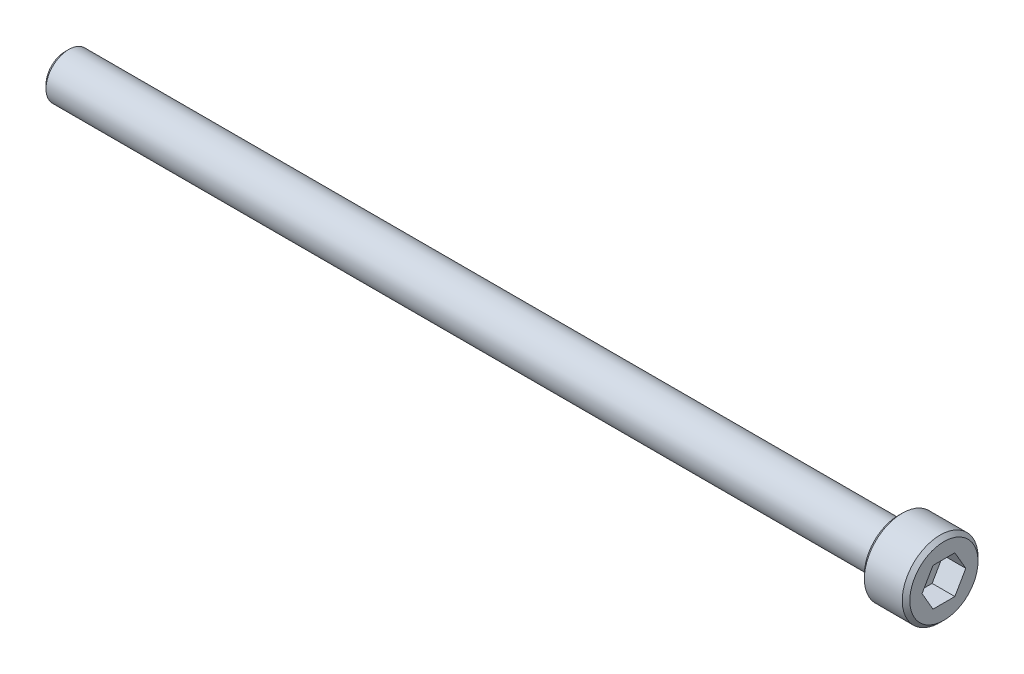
ISO-10303-21;
HEADER;
FILE_DESCRIPTION(('STEP AP214'),'2;1');
FILE_NAME('part.step','',(''),(''),'','','');
FILE_SCHEMA(('AUTOMOTIVE_DESIGN { 1 0 10303 214 1 1 1 1 }'));
ENDSEC;
DATA;
#1=APPLICATION_CONTEXT('core data for automotive mechanical design processes');
#2=APPLICATION_PROTOCOL_DEFINITION('international standard','automotive_design',2000,#1);
#3=PRODUCT_CONTEXT('',#1,'mechanical');
#4=PRODUCT('Part','Part','',(#3));
#5=PRODUCT_RELATED_PRODUCT_CATEGORY('part','',(#4));
#6=PRODUCT_DEFINITION_FORMATION('','',#4);
#7=PRODUCT_DEFINITION_CONTEXT('part definition',#1,'design');
#8=PRODUCT_DEFINITION('design','',#6,#7);
#9=PRODUCT_DEFINITION_SHAPE('','',#8);
#10=(LENGTH_UNIT() NAMED_UNIT(*) SI_UNIT(.MILLI.,.METRE.));
#11=(NAMED_UNIT(*) PLANE_ANGLE_UNIT() SI_UNIT($,.RADIAN.));
#12=(NAMED_UNIT(*) SI_UNIT($,.STERADIAN.) SOLID_ANGLE_UNIT());
#13=UNCERTAINTY_MEASURE_WITH_UNIT(LENGTH_MEASURE(1.E-05),#10,'distance_accuracy_value','');
#14=(GEOMETRIC_REPRESENTATION_CONTEXT(3) GLOBAL_UNCERTAINTY_ASSIGNED_CONTEXT((#13)) GLOBAL_UNIT_ASSIGNED_CONTEXT((#10,
#11,#12)) REPRESENTATION_CONTEXT('',''));
#15=CARTESIAN_POINT('',(0.,0.,0.));
#16=DIRECTION('',(0.,0.,1.));
#17=DIRECTION('',(1.,0.,0.));
#18=AXIS2_PLACEMENT_3D('',#15,#16,#17);
#19=CARTESIAN_POINT('',(-116.,0.,0.));
#20=DIRECTION('',(-1.,0.,0.));
#21=DIRECTION('',(0.,-1.,0.));
#22=AXIS2_PLACEMENT_3D('',#19,#20,#21);
#23=PLANE('',#22);
#24=CARTESIAN_POINT('',(-116.,0.,0.));
#25=DIRECTION('',(-1.,0.,0.));
#26=DIRECTION('',(0.,-1.,0.));
#27=AXIS2_PLACEMENT_3D('',#24,#25,#26);
#28=CIRCLE('',#27,2.50000000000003);
#29=CARTESIAN_POINT('',(-116.,-2.50000000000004,0.));
#30=VERTEX_POINT('',#29);
#31=EDGE_CURVE('E11',#30,#30,#28,.T.);
#32=ORIENTED_EDGE('',*,*,#31,.T.);
#33=EDGE_LOOP('',(#32));
#34=FACE_BOUND('',#33,.T.);
#35=ADVANCED_FACE('F43',(#34),#23,.T.);
#36=CARTESIAN_POINT('',(0.,0.,0.));
#37=DIRECTION('',(1.,0.,0.));
#38=DIRECTION('',(0.,1.,0.));
#39=AXIS2_PLACEMENT_3D('',#36,#37,#38);
#40=CYLINDRICAL_SURFACE('',#39,2.99999999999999);
#41=CARTESIAN_POINT('',(-115.5,0.,0.));
#42=DIRECTION('',(-1.,0.,0.));
#43=DIRECTION('',(0.,-1.,0.));
#44=AXIS2_PLACEMENT_3D('',#41,#42,#43);
#45=CIRCLE('',#44,2.99999999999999);
#46=CARTESIAN_POINT('',(-115.5,-3.00000000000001,0.));
#47=VERTEX_POINT('',#46);
#48=EDGE_CURVE('E53',#47,#47,#45,.F.);
#49=ORIENTED_EDGE('',*,*,#48,.T.);
#50=EDGE_LOOP('',(#49));
#51=FACE_BOUND('',#50,.T.);
#52=CARTESIAN_POINT('',(-6.,0.,0.));
#53=DIRECTION('',(1.,0.,0.));
#54=DIRECTION('',(0.,1.,0.));
#55=AXIS2_PLACEMENT_3D('',#52,#53,#54);
#56=CIRCLE('',#55,2.99999999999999);
#57=CARTESIAN_POINT('',(-6.,2.99999999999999,0.));
#58=VERTEX_POINT('',#57);
#59=EDGE_CURVE('E159',#58,#58,#56,.T.);
#60=ORIENTED_EDGE('',*,*,#59,.F.);
#61=EDGE_LOOP('',(#60));
#62=FACE_BOUND('',#61,.T.);
#63=ADVANCED_FACE('F191',(#51,#62),#40,.T.);
#64=CARTESIAN_POINT('',(-6.,2.99999999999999,0.));
#65=DIRECTION('',(-1.,0.,0.));
#66=DIRECTION('',(0.,-1.,0.));
#67=AXIS2_PLACEMENT_3D('',#64,#65,#66);
#68=PLANE('',#67);
#69=CARTESIAN_POINT('',(-6.,0.,0.));
#70=DIRECTION('',(-1.,0.,0.));
#71=DIRECTION('',(0.,-1.,0.));
#72=AXIS2_PLACEMENT_3D('',#69,#70,#71);
#73=CIRCLE('',#72,4.49999999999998);
#74=CARTESIAN_POINT('',(-6.,-4.49999999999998,0.));
#75=VERTEX_POINT('',#74);
#76=EDGE_CURVE('E184',#75,#75,#73,.T.);
#77=ORIENTED_EDGE('',*,*,#76,.T.);
#78=EDGE_LOOP('',(#77));
#79=FACE_BOUND('',#78,.T.);
#80=ORIENTED_EDGE('',*,*,#59,.T.);
#81=EDGE_LOOP('',(#80));
#82=FACE_BOUND('',#81,.T.);
#83=ADVANCED_FACE('F209',(#79,#82),#68,.T.);
#84=CARTESIAN_POINT('',(0.,0.,0.));
#85=DIRECTION('',(1.,0.,0.));
#86=DIRECTION('',(0.,1.,0.));
#87=AXIS2_PLACEMENT_3D('',#84,#85,#86);
#88=CYLINDRICAL_SURFACE('',#87,5.);
#89=CARTESIAN_POINT('',(-0.5,0.,0.));
#90=DIRECTION('',(1.,0.,0.));
#91=DIRECTION('',(0.,1.,0.));
#92=AXIS2_PLACEMENT_3D('',#89,#90,#91);
#93=CIRCLE('',#92,5.);
#94=CARTESIAN_POINT('',(-0.500000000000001,5.,0.));
#95=VERTEX_POINT('',#94);
#96=EDGE_CURVE('E180',#95,#95,#93,.F.);
#97=ORIENTED_EDGE('',*,*,#96,.T.);
#98=EDGE_LOOP('',(#97));
#99=FACE_BOUND('',#98,.T.);
#100=CARTESIAN_POINT('',(-5.49999999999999,0.,0.));
#101=DIRECTION('',(-1.,0.,0.));
#102=DIRECTION('',(0.,-1.,0.));
#103=AXIS2_PLACEMENT_3D('',#100,#101,#102);
#104=CIRCLE('',#103,5.);
#105=CARTESIAN_POINT('',(-5.49999999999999,-5.,0.));
#106=VERTEX_POINT('',#105);
#107=EDGE_CURVE('E176',#106,#106,#104,.F.);
#108=ORIENTED_EDGE('',*,*,#107,.T.);
#109=EDGE_LOOP('',(#108));
#110=FACE_BOUND('',#109,.T.);
#111=ADVANCED_FACE('F236',(#99,#110),#88,.T.);
#112=CARTESIAN_POINT('',(0.,5.,0.));
#113=DIRECTION('',(1.,0.,0.));
#114=DIRECTION('',(0.,1.,0.));
#115=AXIS2_PLACEMENT_3D('',#112,#113,#114);
#116=PLANE('',#115);
#117=CARTESIAN_POINT('',(0.,0.,0.));
#118=DIRECTION('',(1.,0.,0.));
#119=DIRECTION('',(0.,1.,0.));
#120=AXIS2_PLACEMENT_3D('',#117,#118,#119);
#121=CIRCLE('',#120,4.49999999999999);
#122=CARTESIAN_POINT('',(0.,4.49999999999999,0.));
#123=VERTEX_POINT('',#122);
#124=EDGE_CURVE('E172',#123,#123,#121,.T.);
#125=ORIENTED_EDGE('',*,*,#124,.T.);
#126=EDGE_LOOP('',(#125));
#127=FACE_BOUND('',#126,.T.);
#128=DIRECTION('',(0.,0.866025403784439,-0.5));
#129=VECTOR('',#128,1.);
#130=CARTESIAN_POINT('',(0.,-2.5,-1.44337567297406));
#131=LINE('',#130,#129);
#132=CARTESIAN_POINT('',(0.,-2.5,-1.44337567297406));
#133=VERTEX_POINT('',#132);
#134=CARTESIAN_POINT('',(0.,0.,-2.88675134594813));
#135=VERTEX_POINT('',#134);
#136=EDGE_CURVE('E60',#133,#135,#131,.T.);
#137=ORIENTED_EDGE('',*,*,#136,.F.);
#138=DIRECTION('',(0.,0.,-1.));
#139=VECTOR('',#138,1.);
#140=CARTESIAN_POINT('',(0.,-2.5,1.44337567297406));
#141=LINE('',#140,#139);
#142=CARTESIAN_POINT('',(0.,-2.5,1.44337567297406));
#143=VERTEX_POINT('',#142);
#144=EDGE_CURVE('E153',#143,#133,#141,.T.);
#145=ORIENTED_EDGE('',*,*,#144,.F.);
#146=DIRECTION('',(0.,-0.866025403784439,-0.5));
#147=VECTOR('',#146,1.);
#148=CARTESIAN_POINT('',(0.,0.,2.88675134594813));
#149=LINE('',#148,#147);
#150=CARTESIAN_POINT('',(0.,0.,2.88675134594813));
#151=VERTEX_POINT('',#150);
#152=EDGE_CURVE('E150',#151,#143,#149,.T.);
#153=ORIENTED_EDGE('',*,*,#152,.F.);
#154=DIRECTION('',(0.,-0.866025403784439,0.5));
#155=VECTOR('',#154,1.);
#156=CARTESIAN_POINT('',(0.,2.5,1.44337567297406));
#157=LINE('',#156,#155);
#158=CARTESIAN_POINT('',(0.,2.5,1.44337567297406));
#159=VERTEX_POINT('',#158);
#160=EDGE_CURVE('E108',#159,#151,#157,.T.);
#161=ORIENTED_EDGE('',*,*,#160,.F.);
#162=DIRECTION('',(0.,0.,1.));
#163=VECTOR('',#162,1.);
#164=CARTESIAN_POINT('',(0.,2.5,-1.44337567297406));
#165=LINE('',#164,#163);
#166=CARTESIAN_POINT('',(0.,2.5,-1.44337567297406));
#167=VERTEX_POINT('',#166);
#168=EDGE_CURVE('E144',#167,#159,#165,.T.);
#169=ORIENTED_EDGE('',*,*,#168,.F.);
#170=DIRECTION('',(0.,0.866025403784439,0.5));
#171=VECTOR('',#170,1.);
#172=CARTESIAN_POINT('',(0.,0.,-2.88675134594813));
#173=LINE('',#172,#171);
#174=EDGE_CURVE('E140',#135,#167,#173,.T.);
#175=ORIENTED_EDGE('',*,*,#174,.F.);
#176=EDGE_LOOP('',(#137,#145,#153,#161,#169,#175));
#177=FACE_BOUND('',#176,.T.);
#178=ADVANCED_FACE('F232',(#127,#177),#116,.T.);
#179=CARTESIAN_POINT('',(-3.,-2.5,-1.44337567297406));
#180=DIRECTION('',(0.,-0.5,-0.866025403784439));
#181=DIRECTION('',(0.,0.866025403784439,-0.5));
#182=AXIS2_PLACEMENT_3D('',#179,#180,#181);
#183=PLANE('',#182);
#184=ORIENTED_EDGE('',*,*,#136,.T.);
#185=DIRECTION('',(1.,0.,0.));
#186=VECTOR('',#185,1.);
#187=CARTESIAN_POINT('',(-3.,0.,-2.88675134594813));
#188=LINE('',#187,#186);
#189=CARTESIAN_POINT('',(-3.,0.,-2.88675134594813));
#190=VERTEX_POINT('',#189);
#191=EDGE_CURVE('E90',#190,#135,#188,.T.);
#192=ORIENTED_EDGE('',*,*,#191,.F.);
#193=DIRECTION('',(0.,0.866025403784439,-0.5));
#194=VECTOR('',#193,1.);
#195=CARTESIAN_POINT('',(-3.,-2.5,-1.44337567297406));
#196=LINE('',#195,#194);
#197=CARTESIAN_POINT('',(-3.,-2.5,-1.44337567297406));
#198=VERTEX_POINT('',#197);
#199=EDGE_CURVE('E156',#198,#190,#196,.T.);
#200=ORIENTED_EDGE('',*,*,#199,.F.);
#201=DIRECTION('',(1.,0.,0.));
#202=VECTOR('',#201,1.);
#203=CARTESIAN_POINT('',(-3.,-2.5,-1.44337567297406));
#204=LINE('',#203,#202);
#205=EDGE_CURVE('E68',#198,#133,#204,.T.);
#206=ORIENTED_EDGE('',*,*,#205,.T.);
#207=EDGE_LOOP('',(#184,#192,#200,#206));
#208=FACE_BOUND('',#207,.T.);
#209=ADVANCED_FACE('F235',(#208),#183,.F.);
#210=CARTESIAN_POINT('',(-3.,-2.5,1.44337567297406));
#211=DIRECTION('',(0.,-1.,0.));
#212=DIRECTION('',(1.,0.,0.));
#213=AXIS2_PLACEMENT_3D('',#210,#211,#212);
#214=PLANE('',#213);
#215=ORIENTED_EDGE('',*,*,#144,.T.);
#216=ORIENTED_EDGE('',*,*,#205,.F.);
#217=DIRECTION('',(0.,0.,-1.));
#218=VECTOR('',#217,1.);
#219=CARTESIAN_POINT('',(-3.,-2.5,1.44337567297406));
#220=LINE('',#219,#218);
#221=CARTESIAN_POINT('',(-3.,-2.5,1.44337567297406));
#222=VERTEX_POINT('',#221);
#223=EDGE_CURVE('E122',#222,#198,#220,.T.);
#224=ORIENTED_EDGE('',*,*,#223,.F.);
#225=DIRECTION('',(1.,0.,0.));
#226=VECTOR('',#225,1.);
#227=CARTESIAN_POINT('',(-3.,-2.5,1.44337567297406));
#228=LINE('',#227,#226);
#229=EDGE_CURVE('E113',#222,#143,#228,.T.);
#230=ORIENTED_EDGE('',*,*,#229,.T.);
#231=EDGE_LOOP('',(#215,#216,#224,#230));
#232=FACE_BOUND('',#231,.T.);
#233=ADVANCED_FACE('F246',(#232),#214,.F.);
#234=CARTESIAN_POINT('',(-3.,0.,2.88675134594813));
#235=DIRECTION('',(0.,-0.5,0.866025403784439));
#236=DIRECTION('',(0.,-0.866025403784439,-0.5));
#237=AXIS2_PLACEMENT_3D('',#234,#235,#236);
#238=PLANE('',#237);
#239=ORIENTED_EDGE('',*,*,#152,.T.);
#240=ORIENTED_EDGE('',*,*,#229,.F.);
#241=DIRECTION('',(0.,-0.866025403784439,-0.5));
#242=VECTOR('',#241,1.);
#243=CARTESIAN_POINT('',(-3.,0.,2.88675134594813));
#244=LINE('',#243,#242);
#245=CARTESIAN_POINT('',(-3.,0.,2.88675134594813));
#246=VERTEX_POINT('',#245);
#247=EDGE_CURVE('E117',#246,#222,#244,.T.);
#248=ORIENTED_EDGE('',*,*,#247,.F.);
#249=DIRECTION('',(1.,0.,0.));
#250=VECTOR('',#249,1.);
#251=CARTESIAN_POINT('',(-3.,0.,2.88675134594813));
#252=LINE('',#251,#250);
#253=EDGE_CURVE('E101',#246,#151,#252,.T.);
#254=ORIENTED_EDGE('',*,*,#253,.T.);
#255=EDGE_LOOP('',(#239,#240,#248,#254));
#256=FACE_BOUND('',#255,.T.);
#257=ADVANCED_FACE('F118',(#256),#238,.F.);
#258=CARTESIAN_POINT('',(-3.,2.5,1.44337567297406));
#259=DIRECTION('',(0.,0.5,0.866025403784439));
#260=DIRECTION('',(0.,-0.866025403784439,0.5));
#261=AXIS2_PLACEMENT_3D('',#258,#259,#260);
#262=PLANE('',#261);
#263=ORIENTED_EDGE('',*,*,#160,.T.);
#264=ORIENTED_EDGE('',*,*,#253,.F.);
#265=DIRECTION('',(0.,-0.866025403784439,0.5));
#266=VECTOR('',#265,1.);
#267=CARTESIAN_POINT('',(-3.,2.5,1.44337567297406));
#268=LINE('',#267,#266);
#269=CARTESIAN_POINT('',(-3.,2.5,1.44337567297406));
#270=VERTEX_POINT('',#269);
#271=EDGE_CURVE('E105',#270,#246,#268,.T.);
#272=ORIENTED_EDGE('',*,*,#271,.F.);
#273=DIRECTION('',(1.,0.,0.));
#274=VECTOR('',#273,1.);
#275=CARTESIAN_POINT('',(-3.,2.5,1.44337567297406));
#276=LINE('',#275,#274);
#277=EDGE_CURVE('E114',#270,#159,#276,.T.);
#278=ORIENTED_EDGE('',*,*,#277,.T.);
#279=EDGE_LOOP('',(#263,#264,#272,#278));
#280=FACE_BOUND('',#279,.T.);
#281=ADVANCED_FACE('F103',(#280),#262,.F.);
#282=CARTESIAN_POINT('',(-3.,2.5,-1.44337567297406));
#283=DIRECTION('',(0.,1.,0.));
#284=DIRECTION('',(-1.,0.,0.));
#285=AXIS2_PLACEMENT_3D('',#282,#283,#284);
#286=PLANE('',#285);
#287=ORIENTED_EDGE('',*,*,#168,.T.);
#288=ORIENTED_EDGE('',*,*,#277,.F.);
#289=DIRECTION('',(0.,0.,1.));
#290=VECTOR('',#289,1.);
#291=CARTESIAN_POINT('',(-3.,2.5,-1.44337567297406));
#292=LINE('',#291,#290);
#293=CARTESIAN_POINT('',(-3.,2.5,-1.44337567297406));
#294=VERTEX_POINT('',#293);
#295=EDGE_CURVE('E128',#294,#270,#292,.T.);
#296=ORIENTED_EDGE('',*,*,#295,.F.);
#297=DIRECTION('',(1.,0.,0.));
#298=VECTOR('',#297,1.);
#299=CARTESIAN_POINT('',(-3.,2.5,-1.44337567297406));
#300=LINE('',#299,#298);
#301=EDGE_CURVE('E164',#294,#167,#300,.T.);
#302=ORIENTED_EDGE('',*,*,#301,.T.);
#303=EDGE_LOOP('',(#287,#288,#296,#302));
#304=FACE_BOUND('',#303,.T.);
#305=ADVANCED_FACE('F308',(#304),#286,.F.);
#306=CARTESIAN_POINT('',(-3.,0.,-2.88675134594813));
#307=DIRECTION('',(0.,0.5,-0.866025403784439));
#308=DIRECTION('',(0.,0.866025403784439,0.5));
#309=AXIS2_PLACEMENT_3D('',#306,#307,#308);
#310=PLANE('',#309);
#311=ORIENTED_EDGE('',*,*,#174,.T.);
#312=ORIENTED_EDGE('',*,*,#301,.F.);
#313=DIRECTION('',(0.,0.866025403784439,0.5));
#314=VECTOR('',#313,1.);
#315=CARTESIAN_POINT('',(-3.,0.,-2.88675134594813));
#316=LINE('',#315,#314);
#317=EDGE_CURVE('E132',#190,#294,#316,.T.);
#318=ORIENTED_EDGE('',*,*,#317,.F.);
#319=ORIENTED_EDGE('',*,*,#191,.T.);
#320=EDGE_LOOP('',(#311,#312,#318,#319));
#321=FACE_BOUND('',#320,.T.);
#322=ADVANCED_FACE('F226',(#321),#310,.F.);
#323=CARTESIAN_POINT('',(-3.,0.,0.));
#324=DIRECTION('',(1.,0.,0.));
#325=DIRECTION('',(0.,1.,0.));
#326=AXIS2_PLACEMENT_3D('',#323,#324,#325);
#327=PLANE('',#326);
#328=ORIENTED_EDGE('',*,*,#199,.T.);
#329=ORIENTED_EDGE('',*,*,#317,.T.);
#330=ORIENTED_EDGE('',*,*,#295,.T.);
#331=ORIENTED_EDGE('',*,*,#271,.T.);
#332=ORIENTED_EDGE('',*,*,#247,.T.);
#333=ORIENTED_EDGE('',*,*,#223,.T.);
#334=EDGE_LOOP('',(#328,#329,#330,#331,#332,#333));
#335=FACE_BOUND('',#334,.T.);
#336=ADVANCED_FACE('F125',(#335),#327,.T.);
#337=CARTESIAN_POINT('',(0.,0.,0.));
#338=DIRECTION('',(-1.,0.,0.));
#339=DIRECTION('',(0.,-1.,0.));
#340=AXIS2_PLACEMENT_3D('',#337,#338,#339);
#341=CONICAL_SURFACE('',#340,4.49999999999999,0.785398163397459);
#342=ORIENTED_EDGE('',*,*,#96,.F.);
#343=EDGE_LOOP('',(#342));
#344=FACE_BOUND('',#343,.T.);
#345=ORIENTED_EDGE('',*,*,#124,.F.);
#346=EDGE_LOOP('',(#345));
#347=FACE_BOUND('',#346,.T.);
#348=ADVANCED_FACE('F200',(#344,#347),#341,.T.);
#349=CARTESIAN_POINT('',(-5.49999999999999,0.,0.));
#350=DIRECTION('',(1.,0.,0.));
#351=DIRECTION('',(0.,1.,0.));
#352=AXIS2_PLACEMENT_3D('',#349,#350,#351);
#353=CONICAL_SURFACE('',#352,5.,0.785398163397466);
#354=ORIENTED_EDGE('',*,*,#76,.F.);
#355=EDGE_LOOP('',(#354));
#356=FACE_BOUND('',#355,.T.);
#357=ORIENTED_EDGE('',*,*,#107,.F.);
#358=EDGE_LOOP('',(#357));
#359=FACE_BOUND('',#358,.T.);
#360=ADVANCED_FACE('F195',(#356,#359),#353,.T.);
#361=CARTESIAN_POINT('',(-115.5,0.,0.));
#362=DIRECTION('',(1.,0.,0.));
#363=DIRECTION('',(0.,1.,0.));
#364=AXIS2_PLACEMENT_3D('',#361,#362,#363);
#365=CONICAL_SURFACE('',#364,2.99999999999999,0.785398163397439);
#366=ORIENTED_EDGE('',*,*,#31,.F.);
#367=EDGE_LOOP('',(#366));
#368=FACE_BOUND('',#367,.T.);
#369=ORIENTED_EDGE('',*,*,#48,.F.);
#370=EDGE_LOOP('',(#369));
#371=FACE_BOUND('',#370,.T.);
#372=ADVANCED_FACE('F46',(#368,#371),#365,.T.);
#373=CLOSED_SHELL('',(#35,#63,#83,#111,#178,#209,#233,#257,#281,#305,#322,#336,#348,#360,#372));
#374=MANIFOLD_SOLID_BREP('B2',#373);
#375=ADVANCED_BREP_SHAPE_REPRESENTATION('',(#18,#374),#14);
#376=SHAPE_DEFINITION_REPRESENTATION(#9,#375);
ENDSEC;
END-ISO-10303-21;
